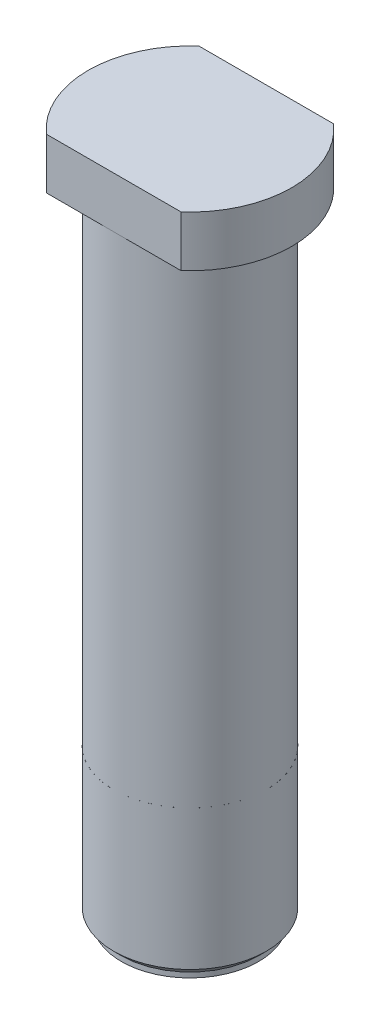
ISO-10303-21;
HEADER;
FILE_DESCRIPTION(('STEP AP214'),'2;1');
FILE_NAME('part.step','',(''),(''),'','','');
FILE_SCHEMA(('AUTOMOTIVE_DESIGN { 1 0 10303 214 1 1 1 1 }'));
ENDSEC;
DATA;
#1=APPLICATION_CONTEXT('core data for automotive mechanical design processes');
#2=APPLICATION_PROTOCOL_DEFINITION('international standard','automotive_design',2000,#1);
#3=PRODUCT_CONTEXT('',#1,'mechanical');
#4=PRODUCT('Part','Part','',(#3));
#5=PRODUCT_RELATED_PRODUCT_CATEGORY('part','',(#4));
#6=PRODUCT_DEFINITION_FORMATION('','',#4);
#7=PRODUCT_DEFINITION_CONTEXT('part definition',#1,'design');
#8=PRODUCT_DEFINITION('design','',#6,#7);
#9=PRODUCT_DEFINITION_SHAPE('','',#8);
#10=(LENGTH_UNIT() NAMED_UNIT(*) SI_UNIT(.MILLI.,.METRE.));
#11=(NAMED_UNIT(*) PLANE_ANGLE_UNIT() SI_UNIT($,.RADIAN.));
#12=(NAMED_UNIT(*) SI_UNIT($,.STERADIAN.) SOLID_ANGLE_UNIT());
#13=UNCERTAINTY_MEASURE_WITH_UNIT(LENGTH_MEASURE(1.E-05),#10,'distance_accuracy_value','');
#14=(GEOMETRIC_REPRESENTATION_CONTEXT(3) GLOBAL_UNCERTAINTY_ASSIGNED_CONTEXT((#13)) GLOBAL_UNIT_ASSIGNED_CONTEXT((#10,
#11,#12)) REPRESENTATION_CONTEXT('',''));
#15=CARTESIAN_POINT('',(0.,0.,0.));
#16=DIRECTION('',(0.,0.,1.));
#17=DIRECTION('',(1.,0.,0.));
#18=AXIS2_PLACEMENT_3D('',#15,#16,#17);
#19=CARTESIAN_POINT('',(0.,16.,0.));
#20=DIRECTION('',(0.,-1.,0.));
#21=DIRECTION('',(0.,0.,-1.));
#22=AXIS2_PLACEMENT_3D('',#19,#20,#21);
#23=PLANE('',#22);
#24=DIRECTION('',(1.,0.,0.));
#25=VECTOR('',#24,1.);
#26=CARTESIAN_POINT('',(-2.645751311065,16.,-3.));
#27=LINE('',#26,#25);
#28=CARTESIAN_POINT('',(2.64575131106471,16.,-2.9999999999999));
#29=VERTEX_POINT('',#28);
#30=CARTESIAN_POINT('',(-2.6457513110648,16.,-3.));
#31=VERTEX_POINT('',#30);
#32=EDGE_CURVE('P0_E64',#29,#31,#27,.F.);
#33=ORIENTED_EDGE('',*,*,#32,.T.);
#34=CARTESIAN_POINT('',(0.,16.,0.));
#35=DIRECTION('',(0.,-1.,0.));
#36=DIRECTION('',(0.,0.,-1.));
#37=AXIS2_PLACEMENT_3D('',#34,#35,#36);
#38=CIRCLE('',#37,4.);
#39=CARTESIAN_POINT('',(-2.6457513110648,16.,3.));
#40=VERTEX_POINT('',#39);
#41=EDGE_CURVE('P0_E19',#40,#31,#38,.T.);
#42=ORIENTED_EDGE('',*,*,#41,.F.);
#43=DIRECTION('',(-1.,0.,0.));
#44=VECTOR('',#43,1.);
#45=CARTESIAN_POINT('',(2.645751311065,16.,3.));
#46=LINE('',#45,#44);
#47=CARTESIAN_POINT('',(2.6457513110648,16.,3.));
#48=VERTEX_POINT('',#47);
#49=EDGE_CURVE('P0_E62',#40,#48,#46,.F.);
#50=ORIENTED_EDGE('',*,*,#49,.T.);
#51=CARTESIAN_POINT('',(0.,16.,0.));
#52=DIRECTION('',(0.,-1.,0.));
#53=DIRECTION('',(0.,0.,-1.));
#54=AXIS2_PLACEMENT_3D('',#51,#52,#53);
#55=CIRCLE('',#54,4.);
#56=EDGE_CURVE('P0_E75',#29,#48,#55,.T.);
#57=ORIENTED_EDGE('',*,*,#56,.F.);
#58=EDGE_LOOP('',(#33,#42,#50,#57));
#59=FACE_BOUND('',#58,.T.);
#60=ADVANCED_FACE('P0_F16',(#59),#23,.F.);
#61=CARTESIAN_POINT('',(0.,-11.,0.));
#62=DIRECTION('',(0.,-1.,0.));
#63=DIRECTION('',(0.,0.,-1.));
#64=AXIS2_PLACEMENT_3D('',#61,#62,#63);
#65=PLANE('',#64);
#66=CARTESIAN_POINT('',(0.,-11.0000000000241,0.));
#67=DIRECTION('',(0.,1.,0.));
#68=DIRECTION('',(0.,0.,1.));
#69=AXIS2_PLACEMENT_3D('',#66,#67,#68);
#70=CIRCLE('',#69,2.49999999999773);
#71=CARTESIAN_POINT('',(0.,-11.0000000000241,2.49999999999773));
#72=VERTEX_POINT('',#71);
#73=EDGE_CURVE('P0_E82',#72,#72,#70,.T.);
#74=ORIENTED_EDGE('',*,*,#73,.F.);
#75=EDGE_LOOP('',(#74));
#76=FACE_BOUND('',#75,.T.);
#77=ADVANCED_FACE('P0_F143',(#76),#65,.T.);
#78=CARTESIAN_POINT('',(0.,17.35,0.));
#79=DIRECTION('',(0.,-1.,0.));
#80=DIRECTION('',(0.,0.,-1.));
#81=AXIS2_PLACEMENT_3D('',#78,#79,#80);
#82=CYLINDRICAL_SURFACE('',#81,4.);
#83=DIRECTION('',(0.,1.,0.));
#84=VECTOR('',#83,1.);
#85=CARTESIAN_POINT('',(-2.645751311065,16.,-3.));
#86=LINE('',#85,#84);
#87=CARTESIAN_POINT('',(-2.6457513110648,14.,-3.));
#88=VERTEX_POINT('',#87);
#89=EDGE_CURVE('P0_E86',#31,#88,#86,.F.);
#90=ORIENTED_EDGE('',*,*,#89,.T.);
#91=CARTESIAN_POINT('',(0.,14.,0.));
#92=DIRECTION('',(0.,-1.,0.));
#93=DIRECTION('',(0.,0.,-1.));
#94=AXIS2_PLACEMENT_3D('',#91,#92,#93);
#95=CIRCLE('',#94,4.);
#96=CARTESIAN_POINT('',(-2.6457513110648,14.,3.));
#97=VERTEX_POINT('',#96);
#98=EDGE_CURVE('P0_E71',#97,#88,#95,.T.);
#99=ORIENTED_EDGE('',*,*,#98,.F.);
#100=DIRECTION('',(0.,1.,0.));
#101=VECTOR('',#100,1.);
#102=CARTESIAN_POINT('',(-2.645751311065,16.,3.));
#103=LINE('',#102,#101);
#104=EDGE_CURVE('P0_E68',#97,#40,#103,.T.);
#105=ORIENTED_EDGE('',*,*,#104,.T.);
#106=ORIENTED_EDGE('',*,*,#41,.T.);
#107=EDGE_LOOP('',(#90,#99,#105,#106));
#108=FACE_BOUND('',#107,.T.);
#109=ADVANCED_FACE('P0_F69',(#108),#82,.T.);
#110=CARTESIAN_POINT('',(-2.645751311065,16.,-3.));
#111=DIRECTION('',(0.,0.,1.));
#112=DIRECTION('',(1.,0.,0.));
#113=AXIS2_PLACEMENT_3D('',#110,#111,#112);
#114=PLANE('',#113);
#115=ORIENTED_EDGE('',*,*,#32,.F.);
#116=DIRECTION('',(0.,-1.,0.));
#117=VECTOR('',#116,1.);
#118=CARTESIAN_POINT('',(2.64575131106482,17.35,-2.9999999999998));
#119=LINE('',#118,#117);
#120=CARTESIAN_POINT('',(2.64575131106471,14.,-2.9999999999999));
#121=VERTEX_POINT('',#120);
#122=EDGE_CURVE('P0_E99',#121,#29,#119,.F.);
#123=ORIENTED_EDGE('',*,*,#122,.F.);
#124=DIRECTION('',(1.,0.,0.));
#125=VECTOR('',#124,1.);
#126=CARTESIAN_POINT('',(0.,14.,-3.));
#127=LINE('',#126,#125);
#128=CARTESIAN_POINT('',(0.,14.,-3.));
#129=VERTEX_POINT('',#128);
#130=EDGE_CURVE('P0_E34',#129,#121,#127,.T.);
#131=ORIENTED_EDGE('',*,*,#130,.F.);
#132=DIRECTION('',(1.,0.,0.));
#133=VECTOR('',#132,1.);
#134=CARTESIAN_POINT('',(0.,14.,-3.));
#135=LINE('',#134,#133);
#136=EDGE_CURVE('P0_E96',#88,#129,#135,.T.);
#137=ORIENTED_EDGE('',*,*,#136,.F.);
#138=ORIENTED_EDGE('',*,*,#89,.F.);
#139=EDGE_LOOP('',(#115,#123,#131,#137,#138));
#140=FACE_BOUND('',#139,.T.);
#141=ADVANCED_FACE('P0_F139',(#140),#114,.F.);
#142=CARTESIAN_POINT('',(0.,17.35,0.));
#143=DIRECTION('',(0.,-1.,0.));
#144=DIRECTION('',(0.,0.,-1.));
#145=AXIS2_PLACEMENT_3D('',#142,#143,#144);
#146=CYLINDRICAL_SURFACE('',#145,4.);
#147=ORIENTED_EDGE('',*,*,#122,.T.);
#148=ORIENTED_EDGE('',*,*,#56,.T.);
#149=DIRECTION('',(0.,1.,0.));
#150=VECTOR('',#149,1.);
#151=CARTESIAN_POINT('',(2.645751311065,16.,3.));
#152=LINE('',#151,#150);
#153=CARTESIAN_POINT('',(2.6457513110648,14.,3.));
#154=VERTEX_POINT('',#153);
#155=EDGE_CURVE('P0_E80',#48,#154,#152,.F.);
#156=ORIENTED_EDGE('',*,*,#155,.T.);
#157=CARTESIAN_POINT('',(0.,14.,0.));
#158=DIRECTION('',(0.,-1.,0.));
#159=DIRECTION('',(0.,0.,-1.));
#160=AXIS2_PLACEMENT_3D('',#157,#158,#159);
#161=CIRCLE('',#160,4.);
#162=EDGE_CURVE('P0_E91',#121,#154,#161,.T.);
#163=ORIENTED_EDGE('',*,*,#162,.F.);
#164=EDGE_LOOP('',(#147,#148,#156,#163));
#165=FACE_BOUND('',#164,.T.);
#166=ADVANCED_FACE('P0_F136',(#165),#146,.T.);
#167=CARTESIAN_POINT('',(2.645751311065,16.,3.));
#168=DIRECTION('',(0.,0.,-1.));
#169=DIRECTION('',(-1.,0.,0.));
#170=AXIS2_PLACEMENT_3D('',#167,#168,#169);
#171=PLANE('',#170);
#172=ORIENTED_EDGE('',*,*,#49,.F.);
#173=ORIENTED_EDGE('',*,*,#104,.F.);
#174=DIRECTION('',(1.,0.,0.));
#175=VECTOR('',#174,1.);
#176=CARTESIAN_POINT('',(0.,14.,3.));
#177=LINE('',#176,#175);
#178=CARTESIAN_POINT('',(0.,14.,3.));
#179=VERTEX_POINT('',#178);
#180=EDGE_CURVE('P0_E97',#179,#97,#177,.F.);
#181=ORIENTED_EDGE('',*,*,#180,.F.);
#182=DIRECTION('',(1.,0.,0.));
#183=VECTOR('',#182,1.);
#184=CARTESIAN_POINT('',(0.,14.,3.));
#185=LINE('',#184,#183);
#186=EDGE_CURVE('P0_E94',#154,#179,#185,.F.);
#187=ORIENTED_EDGE('',*,*,#186,.F.);
#188=ORIENTED_EDGE('',*,*,#155,.F.);
#189=EDGE_LOOP('',(#172,#173,#181,#187,#188));
#190=FACE_BOUND('',#189,.T.);
#191=ADVANCED_FACE('P0_F78',(#190),#171,.F.);
#192=CARTESIAN_POINT('',(0.,-10.5000000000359,0.));
#193=DIRECTION('',(0.,1.,0.));
#194=DIRECTION('',(0.,0.,1.));
#195=AXIS2_PLACEMENT_3D('',#192,#193,#194);
#196=CONICAL_SURFACE('',#195,2.9999999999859,0.785398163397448);
#197=ORIENTED_EDGE('',*,*,#73,.T.);
#198=EDGE_LOOP('',(#197));
#199=FACE_BOUND('',#198,.T.);
#200=CARTESIAN_POINT('',(0.,-10.5,0.));
#201=DIRECTION('',(0.,-1.,0.));
#202=DIRECTION('',(0.,0.,-1.));
#203=AXIS2_PLACEMENT_3D('',#200,#201,#202);
#204=CIRCLE('',#203,3.);
#205=CARTESIAN_POINT('',(0.,-10.5,-3.));
#206=VERTEX_POINT('',#205);
#207=EDGE_CURVE('P0_E90',#206,#206,#204,.F.);
#208=ORIENTED_EDGE('',*,*,#207,.F.);
#209=EDGE_LOOP('',(#208));
#210=FACE_BOUND('',#209,.T.);
#211=ADVANCED_FACE('P0_F130',(#199,#210),#196,.T.);
#212=CARTESIAN_POINT('',(0.,14.,0.));
#213=DIRECTION('',(0.,-1.,0.));
#214=DIRECTION('',(0.,0.,-1.));
#215=AXIS2_PLACEMENT_3D('',#212,#213,#214);
#216=PLANE('',#215);
#217=ORIENTED_EDGE('',*,*,#98,.T.);
#218=ORIENTED_EDGE('',*,*,#136,.T.);
#219=CARTESIAN_POINT('',(0.,14.,0.));
#220=DIRECTION('',(0.,-1.,0.));
#221=DIRECTION('',(0.,0.,-1.));
#222=AXIS2_PLACEMENT_3D('',#219,#220,#221);
#223=CIRCLE('',#222,3.);
#224=EDGE_CURVE('P0_E25',#179,#129,#223,.T.);
#225=ORIENTED_EDGE('',*,*,#224,.F.);
#226=ORIENTED_EDGE('',*,*,#180,.T.);
#227=EDGE_LOOP('',(#217,#218,#225,#226));
#228=FACE_BOUND('',#227,.T.);
#229=ADVANCED_FACE('P0_F116',(#228),#216,.T.);
#230=CARTESIAN_POINT('',(0.,14.,0.));
#231=DIRECTION('',(0.,-1.,0.));
#232=DIRECTION('',(0.,0.,-1.));
#233=AXIS2_PLACEMENT_3D('',#230,#231,#232);
#234=PLANE('',#233);
#235=ORIENTED_EDGE('',*,*,#162,.T.);
#236=ORIENTED_EDGE('',*,*,#186,.T.);
#237=CARTESIAN_POINT('',(0.,14.,0.));
#238=DIRECTION('',(0.,-1.,0.));
#239=DIRECTION('',(0.,0.,-1.));
#240=AXIS2_PLACEMENT_3D('',#237,#238,#239);
#241=CIRCLE('',#240,3.);
#242=EDGE_CURVE('P0_E11',#129,#179,#241,.T.);
#243=ORIENTED_EDGE('',*,*,#242,.F.);
#244=ORIENTED_EDGE('',*,*,#130,.T.);
#245=EDGE_LOOP('',(#235,#236,#243,#244));
#246=FACE_BOUND('',#245,.T.);
#247=ADVANCED_FACE('P0_F113',(#246),#234,.T.);
#248=CARTESIAN_POINT('',(0.,17.35,0.));
#249=DIRECTION('',(0.,-1.,0.));
#250=DIRECTION('',(0.,0.,-1.));
#251=AXIS2_PLACEMENT_3D('',#248,#249,#250);
#252=CYLINDRICAL_SURFACE('',#251,3.);
#253=ORIENTED_EDGE('',*,*,#207,.T.);
#254=EDGE_LOOP('',(#253));
#255=FACE_BOUND('',#254,.T.);
#256=ORIENTED_EDGE('',*,*,#224,.T.);
#257=ORIENTED_EDGE('',*,*,#242,.T.);
#258=EDGE_LOOP('',(#256,#257));
#259=FACE_BOUND('',#258,.T.);
#260=ADVANCED_FACE('P0_F118',(#255,#259),#252,.T.);
#261=CLOSED_SHELL('',(#60,#77,#109,#141,#166,#191,#211,#229,#247,#260));
#262=MANIFOLD_SOLID_BREP('P0_B1',#261);
#263=CARTESIAN_POINT('',(0.,-11.,0.));
#264=DIRECTION('',(0.,-1.,0.));
#265=DIRECTION('',(0.,0.,-1.));
#266=AXIS2_PLACEMENT_3D('',#263,#264,#265);
#267=CYLINDRICAL_SURFACE('',#266,2.7);
#268=CARTESIAN_POINT('',(0.,-5.,0.));
#269=DIRECTION('',(0.,-1.,0.));
#270=DIRECTION('',(0.,0.,-1.));
#271=AXIS2_PLACEMENT_3D('',#268,#269,#270);
#272=CIRCLE('',#271,2.7);
#273=CARTESIAN_POINT('',(0.,-5.,-2.7));
#274=VERTEX_POINT('',#273);
#275=EDGE_CURVE('P1_E20',#274,#274,#272,.T.);
#276=ORIENTED_EDGE('',*,*,#275,.T.);
#277=EDGE_LOOP('',(#276));
#278=FACE_BOUND('',#277,.T.);
#279=CARTESIAN_POINT('',(0.,-11.,0.));
#280=DIRECTION('',(0.,-1.,0.));
#281=DIRECTION('',(0.,0.,-1.));
#282=AXIS2_PLACEMENT_3D('',#279,#280,#281);
#283=CIRCLE('',#282,2.7);
#284=CARTESIAN_POINT('',(0.,-11.,-2.7));
#285=VERTEX_POINT('',#284);
#286=EDGE_CURVE('P1_E11',#285,#285,#283,.F.);
#287=ORIENTED_EDGE('',*,*,#286,.T.);
#288=EDGE_LOOP('',(#287));
#289=FACE_BOUND('',#288,.T.);
#290=ADVANCED_FACE('P1_F16',(#278,#289),#267,.T.);
#291=CARTESIAN_POINT('',(0.,-5.,0.));
#292=DIRECTION('',(0.,-1.,0.));
#293=DIRECTION('',(0.,0.,-1.));
#294=AXIS2_PLACEMENT_3D('',#291,#292,#293);
#295=PLANE('',#294);
#296=ORIENTED_EDGE('',*,*,#275,.F.);
#297=EDGE_LOOP('',(#296));
#298=FACE_BOUND('',#297,.T.);
#299=CARTESIAN_POINT('',(-3.,-5.,0.));
#300=CARTESIAN_POINT('',(-2.99979758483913,-5.,-0.572474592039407));
#301=CARTESIAN_POINT('',(-2.7893649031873,-5.,-1.1042841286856));
#302=CARTESIAN_POINT('',(-2.56095382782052,-5.,-1.68152900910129));
#303=CARTESIAN_POINT('',(-2.12132034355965,-5.,-2.12132034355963));
#304=CARTESIAN_POINT('',(-1.68243191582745,-5.,-2.56036635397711));
#305=CARTESIAN_POINT('',(-1.10428412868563,-5.,-2.78936490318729));
#306=CARTESIAN_POINT('',(-0.572753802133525,-5.,-2.99989874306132));
#307=CARTESIAN_POINT('',(0.,-5.,-3.));
#308=CARTESIAN_POINT('',(0.571707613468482,-5.,-3.00010107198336));
#309=CARTESIAN_POINT('',(1.10428412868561,-5.,-2.7893649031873));
#310=CARTESIAN_POINT('',(1.68152900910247,-5.,-2.56095382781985));
#311=CARTESIAN_POINT('',(2.12132034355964,-5.,-2.12132034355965));
#312=CARTESIAN_POINT('',(2.56036635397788,-5.,-1.68243191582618));
#313=CARTESIAN_POINT('',(2.78936490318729,-5.,-1.10428412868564));
#314=CARTESIAN_POINT('',(2.999797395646,-5.,-0.573009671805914));
#315=CARTESIAN_POINT('',(3.,-5.,0.));
#316=B_SPLINE_CURVE_WITH_KNOTS('',2,(#299,#300,#301,#302,#303,#304,#305,#306,#307,#308,#309,
#310,#311,#312,#313,#314,#315),.UNSPECIFIED.,.F.,.F.,(3,2,2,2,2,2,2,2,3),(0.,0.125,0.25,0.375,
0.5,0.625,0.75,0.875,1.),.UNSPECIFIED.);
#317=CARTESIAN_POINT('',(-3.,-5.,0.));
#318=VERTEX_POINT('',#317);
#319=CARTESIAN_POINT('',(3.,-5.,0.));
#320=VERTEX_POINT('',#319);
#321=EDGE_CURVE('P1_E30',#318,#320,#316,.T.);
#322=ORIENTED_EDGE('',*,*,#321,.T.);
#323=CARTESIAN_POINT('',(3.,-5.,0.));
#324=CARTESIAN_POINT('',(2.99979758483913,-5.,0.572474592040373));
#325=CARTESIAN_POINT('',(2.7893649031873,-5.,1.1042841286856));
#326=CARTESIAN_POINT('',(2.56095382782,-5.,1.68152900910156));
#327=CARTESIAN_POINT('',(2.12132034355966,-5.,2.12132034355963));
#328=CARTESIAN_POINT('',(1.68243191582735,-5.,2.56036635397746));
#329=CARTESIAN_POINT('',(1.10428412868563,-5.,2.78936490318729));
#330=CARTESIAN_POINT('',(0.572753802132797,-5.,2.99989874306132));
#331=CARTESIAN_POINT('',(0.,-5.,3.));
#332=CARTESIAN_POINT('',(-0.571707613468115,-5.,3.00010107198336));
#333=CARTESIAN_POINT('',(-1.10428412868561,-5.,2.7893649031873));
#334=CARTESIAN_POINT('',(-1.68152900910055,-5.,2.56095382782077));
#335=CARTESIAN_POINT('',(-2.12132034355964,-5.,2.12132034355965));
#336=CARTESIAN_POINT('',(-2.56036635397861,-5.,1.68243191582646));
#337=CARTESIAN_POINT('',(-2.78936490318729,-5.,1.10428412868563));
#338=CARTESIAN_POINT('',(-2.999797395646,-5.,0.57300967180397));
#339=CARTESIAN_POINT('',(-3.,-5.,0.));
#340=B_SPLINE_CURVE_WITH_KNOTS('',2,(#323,#324,#325,#326,#327,#328,#329,#330,#331,#332,#333,
#334,#335,#336,#337,#338,#339),.UNSPECIFIED.,.F.,.F.,(3,2,2,2,2,2,2,2,3),(0.,0.125,0.25,0.375,
0.5,0.625,0.75,0.875,1.),.UNSPECIFIED.);
#341=EDGE_CURVE('P1_E33',#320,#318,#340,.T.);
#342=ORIENTED_EDGE('',*,*,#341,.T.);
#343=EDGE_LOOP('',(#322,#342));
#344=FACE_BOUND('',#343,.T.);
#345=ADVANCED_FACE('P1_F17',(#298,#344),#295,.T.);
#346=OPEN_SHELL('',(#290,#345));
#347=SHELL_BASED_SURFACE_MODEL('P1_B1',(#346));
#348=ADVANCED_BREP_SHAPE_REPRESENTATION('',(#18,#262),#14);
#349=MANIFOLD_SURFACE_SHAPE_REPRESENTATION('',(#18,#347),#14);
#350=SHAPE_REPRESENTATION('',(#18),#14);
#351=SHAPE_DEFINITION_REPRESENTATION(#9,#350);
#352=SHAPE_REPRESENTATION_RELATIONSHIP('','',#350,#348);
#353=SHAPE_REPRESENTATION_RELATIONSHIP('','',#350,#349);
ENDSEC;
END-ISO-10303-21;
